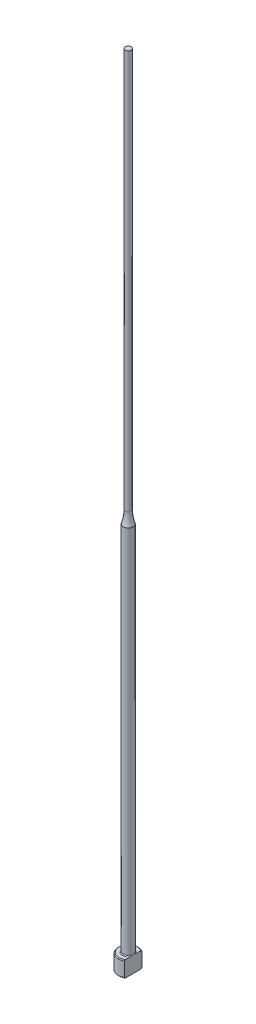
ISO-10303-21;
HEADER;
FILE_DESCRIPTION(('STEP AP214'),'2;1');
FILE_NAME('part.step','',(''),(''),'','','');
FILE_SCHEMA(('AUTOMOTIVE_DESIGN { 1 0 10303 214 1 1 1 1 }'));
ENDSEC;
DATA;
#1=APPLICATION_CONTEXT('core data for automotive mechanical design processes');
#2=APPLICATION_PROTOCOL_DEFINITION('international standard','automotive_design',2000,#1);
#3=PRODUCT_CONTEXT('',#1,'mechanical');
#4=PRODUCT('Part','Part','',(#3));
#5=PRODUCT_RELATED_PRODUCT_CATEGORY('part','',(#4));
#6=PRODUCT_DEFINITION_FORMATION('','',#4);
#7=PRODUCT_DEFINITION_CONTEXT('part definition',#1,'design');
#8=PRODUCT_DEFINITION('design','',#6,#7);
#9=PRODUCT_DEFINITION_SHAPE('','',#8);
#10=(LENGTH_UNIT() NAMED_UNIT(*) SI_UNIT(.MILLI.,.METRE.));
#11=(NAMED_UNIT(*) PLANE_ANGLE_UNIT() SI_UNIT($,.RADIAN.));
#12=(NAMED_UNIT(*) SI_UNIT($,.STERADIAN.) SOLID_ANGLE_UNIT());
#13=UNCERTAINTY_MEASURE_WITH_UNIT(LENGTH_MEASURE(1.E-05),#10,'distance_accuracy_value','');
#14=(GEOMETRIC_REPRESENTATION_CONTEXT(3) GLOBAL_UNCERTAINTY_ASSIGNED_CONTEXT((#13)) GLOBAL_UNIT_ASSIGNED_CONTEXT((#10,
#11,#12)) REPRESENTATION_CONTEXT('',''));
#15=CARTESIAN_POINT('',(0.,0.,0.));
#16=DIRECTION('',(0.,0.,1.));
#17=DIRECTION('',(1.,0.,0.));
#18=AXIS2_PLACEMENT_3D('',#15,#16,#17);
#19=CARTESIAN_POINT('',(-2.49999999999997,4.,0.));
#20=DIRECTION('',(0.,1.,0.));
#21=DIRECTION('',(0.,0.,1.));
#22=AXIS2_PLACEMENT_3D('',#19,#20,#21);
#23=PLANE('',#22);
#24=CARTESIAN_POINT('',(0.,4.,0.));
#25=DIRECTION('',(0.,1.,0.));
#26=DIRECTION('',(0.,0.,1.));
#27=AXIS2_PLACEMENT_3D('',#24,#25,#26);
#28=CIRCLE('',#27,2.3);
#29=CARTESIAN_POINT('',(1.24999999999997,4.,-1.9306734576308));
#30=VERTEX_POINT('',#29);
#31=CARTESIAN_POINT('',(1.24999999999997,4.,1.9306734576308));
#32=VERTEX_POINT('',#31);
#33=EDGE_CURVE('E187',#30,#32,#28,.T.);
#34=ORIENTED_EDGE('',*,*,#33,.T.);
#35=DIRECTION('',(0.,0.,-1.));
#36=VECTOR('',#35,1.);
#37=CARTESIAN_POINT('',(1.24999999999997,4.,0.));
#38=LINE('',#37,#36);
#39=CARTESIAN_POINT('',(1.24999999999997,3.99999999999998,0.734846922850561));
#40=VERTEX_POINT('',#39);
#41=EDGE_CURVE('E57',#32,#40,#38,.T.);
#42=ORIENTED_EDGE('',*,*,#41,.T.);
#43=CARTESIAN_POINT('',(0.,4.,0.));
#44=DIRECTION('',(0.,1.,0.));
#45=DIRECTION('',(0.,0.,1.));
#46=AXIS2_PLACEMENT_3D('',#43,#44,#45);
#47=CIRCLE('',#46,1.44999999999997);
#48=CARTESIAN_POINT('',(1.24999999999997,3.99999999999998,-0.734846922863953));
#49=VERTEX_POINT('',#48);
#50=EDGE_CURVE('E108',#40,#49,#47,.F.);
#51=ORIENTED_EDGE('',*,*,#50,.T.);
#52=EDGE_CURVE('E137',#49,#30,#38,.T.);
#53=ORIENTED_EDGE('',*,*,#52,.T.);
#54=EDGE_LOOP('',(#34,#42,#51,#53));
#55=FACE_BOUND('',#54,.T.);
#56=ADVANCED_FACE('F32',(#55),#23,.T.);
#57=CARTESIAN_POINT('',(0.,259.958771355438,0.));
#58=DIRECTION('',(0.,1.,0.));
#59=DIRECTION('',(0.,0.,1.));
#60=AXIS2_PLACEMENT_3D('',#57,#58,#59);
#61=CYLINDRICAL_SURFACE('',#60,2.49999999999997);
#62=CARTESIAN_POINT('',(0.,3.80000000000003,0.));
#63=DIRECTION('',(0.,1.,0.));
#64=DIRECTION('',(0.,0.,1.));
#65=AXIS2_PLACEMENT_3D('',#62,#63,#64);
#66=CIRCLE('',#65,2.49999999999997);
#67=CARTESIAN_POINT('',(1.24999999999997,3.80000000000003,2.16506350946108));
#68=VERTEX_POINT('',#67);
#69=CARTESIAN_POINT('',(1.24999999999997,3.80000000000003,-2.16506350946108));
#70=VERTEX_POINT('',#69);
#71=EDGE_CURVE('E105',#68,#70,#66,.F.);
#72=ORIENTED_EDGE('',*,*,#71,.T.);
#73=DIRECTION('',(0.,-1.,0.));
#74=VECTOR('',#73,1.);
#75=CARTESIAN_POINT('',(1.24999999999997,200.,-2.16506350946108));
#76=LINE('',#75,#74);
#77=CARTESIAN_POINT('',(1.24999999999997,0.199999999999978,-2.16506350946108));
#78=VERTEX_POINT('',#77);
#79=EDGE_CURVE('E193',#70,#78,#76,.T.);
#80=ORIENTED_EDGE('',*,*,#79,.T.);
#81=CARTESIAN_POINT('',(0.,0.199999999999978,0.));
#82=DIRECTION('',(0.,-1.,0.));
#83=DIRECTION('',(0.,0.,-1.));
#84=AXIS2_PLACEMENT_3D('',#81,#82,#83);
#85=CIRCLE('',#84,2.49999999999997);
#86=CARTESIAN_POINT('',(1.24999999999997,0.199999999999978,2.16506350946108));
#87=VERTEX_POINT('',#86);
#88=EDGE_CURVE('E100',#78,#87,#85,.F.);
#89=ORIENTED_EDGE('',*,*,#88,.T.);
#90=DIRECTION('',(0.,-1.,0.));
#91=VECTOR('',#90,1.);
#92=CARTESIAN_POINT('',(1.24999999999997,200.,2.16506350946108));
#93=LINE('',#92,#91);
#94=EDGE_CURVE('E93',#68,#87,#93,.T.);
#95=ORIENTED_EDGE('',*,*,#94,.F.);
#96=EDGE_LOOP('',(#72,#80,#89,#95));
#97=FACE_BOUND('',#96,.T.);
#98=ADVANCED_FACE('F158',(#97),#61,.T.);
#99=CARTESIAN_POINT('',(0.,0.,0.));
#100=DIRECTION('',(0.,-1.,0.));
#101=DIRECTION('',(0.,0.,-1.));
#102=AXIS2_PLACEMENT_3D('',#99,#100,#101);
#103=PLANE('',#102);
#104=CARTESIAN_POINT('',(0.,0.,0.));
#105=DIRECTION('',(0.,-1.,0.));
#106=DIRECTION('',(0.,0.,-1.));
#107=AXIS2_PLACEMENT_3D('',#104,#105,#106);
#108=CIRCLE('',#107,2.29999999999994);
#109=CARTESIAN_POINT('',(1.24999999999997,0.,1.93067345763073));
#110=VERTEX_POINT('',#109);
#111=CARTESIAN_POINT('',(1.24999999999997,0.,-1.93067345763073));
#112=VERTEX_POINT('',#111);
#113=EDGE_CURVE('E98',#110,#112,#108,.T.);
#114=ORIENTED_EDGE('',*,*,#113,.T.);
#115=DIRECTION('',(0.,0.,1.));
#116=VECTOR('',#115,1.);
#117=CARTESIAN_POINT('',(1.24999999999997,0.,2.16506350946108));
#118=LINE('',#117,#116);
#119=EDGE_CURVE('E83',#112,#110,#118,.T.);
#120=ORIENTED_EDGE('',*,*,#119,.T.);
#121=EDGE_LOOP('',(#114,#120));
#122=FACE_BOUND('',#121,.T.);
#123=ADVANCED_FACE('F103',(#122),#103,.T.);
#124=CARTESIAN_POINT('',(0.,4.,0.));
#125=DIRECTION('',(0.,-1.,0.));
#126=DIRECTION('',(0.,0.,-1.));
#127=AXIS2_PLACEMENT_3D('',#124,#125,#126);
#128=CONICAL_SURFACE('',#127,2.3,0.785398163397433);
#129=ORIENTED_EDGE('',*,*,#71,.F.);
#130=CARTESIAN_POINT('',(1.24999999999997,1.37269850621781,4.76610952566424));
#131=CARTESIAN_POINT('',(1.24999999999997,1.47721375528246,4.6580533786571));
#132=CARTESIAN_POINT('',(1.24999999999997,1.58161686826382,4.54988840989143));
#133=CARTESIAN_POINT('',(1.24999999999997,1.79013244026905,4.33327605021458));
#134=CARTESIAN_POINT('',(1.24999999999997,1.89424489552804,4.22482865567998));
#135=CARTESIAN_POINT('',(1.24999999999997,2.10216338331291,4.00753373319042));
#136=CARTESIAN_POINT('',(1.24999999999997,2.20596923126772,3.89868602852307));
#137=CARTESIAN_POINT('',(1.24999999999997,2.41312192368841,3.68055575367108));
#138=CARTESIAN_POINT('',(1.24999999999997,2.51646877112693,3.57127318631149));
#139=CARTESIAN_POINT('',(1.24999999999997,2.72052253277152,3.35432408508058));
#140=CARTESIAN_POINT('',(1.24999999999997,2.82124112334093,3.24666854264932));
#141=CARTESIAN_POINT('',(1.24999999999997,3.02192410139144,3.03065701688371));
#142=CARTESIAN_POINT('',(1.24999999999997,3.12188849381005,2.92230103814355));
#143=CARTESIAN_POINT('',(1.24999999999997,3.32077037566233,2.70467415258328));
#144=CARTESIAN_POINT('',(1.24999999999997,3.41968808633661,2.59540344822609));
#145=CARTESIAN_POINT('',(1.24999999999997,3.61608273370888,2.37557697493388));
#146=CARTESIAN_POINT('',(1.24999999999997,3.71355972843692,2.26502125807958));
#147=CARTESIAN_POINT('',(1.24999999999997,3.86911393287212,2.08515617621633));
#148=CARTESIAN_POINT('',(1.24999999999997,3.92785594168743,2.01642247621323));
#149=CARTESIAN_POINT('',(1.24999999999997,4.0442937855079,1.87806056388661));
#150=CARTESIAN_POINT('',(1.24999999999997,4.10198951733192,1.80843226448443));
#151=CARTESIAN_POINT('',(1.24999999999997,4.21658041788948,1.66728976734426));
#152=CARTESIAN_POINT('',(1.24999999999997,4.27346067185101,1.59576341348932));
#153=CARTESIAN_POINT('',(1.24999999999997,4.38522965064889,1.45118948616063));
#154=CARTESIAN_POINT('',(1.24999999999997,4.44011885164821,1.37814228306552));
#155=CARTESIAN_POINT('',(1.24999999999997,4.54788773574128,1.22886697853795));
#156=CARTESIAN_POINT('',(1.24999999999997,4.60072420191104,1.15260740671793));
#157=CARTESIAN_POINT('',(1.24999999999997,4.70212030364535,0.997098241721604));
#158=CARTESIAN_POINT('',(1.24999999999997,4.75067405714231,0.917844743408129));
#159=CARTESIAN_POINT('',(1.24999999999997,4.84043729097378,0.756494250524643));
#160=CARTESIAN_POINT('',(1.24999999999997,4.88173033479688,0.674444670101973));
#161=CARTESIAN_POINT('',(1.24999999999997,4.95366083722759,0.505835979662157));
#162=CARTESIAN_POINT('',(1.24999999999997,4.98433405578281,0.419293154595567));
#163=CARTESIAN_POINT('',(1.24999999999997,5.01753107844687,0.289507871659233));
#164=CARTESIAN_POINT('',(1.24999999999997,5.02633539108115,0.247870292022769));
#165=CARTESIAN_POINT('',(1.24999999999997,5.03997448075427,0.163937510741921));
#166=CARTESIAN_POINT('',(1.24999999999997,5.0448096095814,0.12164236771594));
#167=CARTESIAN_POINT('',(1.24999999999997,5.0501678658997,0.0369068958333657));
#168=CARTESIAN_POINT('',(1.24999999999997,5.05070431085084,-0.00553257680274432));
#169=CARTESIAN_POINT('',(1.24999999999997,5.04746162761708,-0.0902467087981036));
#170=CARTESIAN_POINT('',(1.24999999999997,5.04368214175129,-0.132521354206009));
#171=CARTESIAN_POINT('',(1.24999999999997,5.0321226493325,-0.21613542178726));
#172=CARTESIAN_POINT('',(1.24999999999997,5.02437758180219,-0.2574797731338));
#173=CARTESIAN_POINT('',(1.24999999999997,5.00536735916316,-0.339354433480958));
#174=CARTESIAN_POINT('',(1.24999999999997,4.99410082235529,-0.379884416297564));
#175=CARTESIAN_POINT('',(1.24999999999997,4.96852211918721,-0.460209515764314));
#176=CARTESIAN_POINT('',(1.24999999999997,4.954193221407,-0.499999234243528));
#177=CARTESIAN_POINT('',(1.24999999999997,4.92306392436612,-0.578577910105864));
#178=CARTESIAN_POINT('',(1.24999999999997,4.90626403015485,-0.617367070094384));
#179=CARTESIAN_POINT('',(1.24999999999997,4.85269034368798,-0.732719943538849));
#180=CARTESIAN_POINT('',(1.24999999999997,4.81287978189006,-0.807869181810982));
#181=CARTESIAN_POINT('',(1.24999999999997,4.72799210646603,-0.955157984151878));
#182=CARTESIAN_POINT('',(1.24999999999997,4.68290855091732,-1.02729371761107));
#183=CARTESIAN_POINT('',(1.24999999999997,4.58903993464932,-1.16950551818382));
#184=CARTESIAN_POINT('',(1.24999999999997,4.5402409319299,-1.23957230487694));
#185=CARTESIAN_POINT('',(1.24999999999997,4.44021824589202,-1.37788366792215));
#186=CARTESIAN_POINT('',(1.24999999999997,4.38899576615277,-1.44612912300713));
#187=CARTESIAN_POINT('',(1.24999999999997,4.28411092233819,-1.58215279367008));
#188=CARTESIAN_POINT('',(1.24999999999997,4.23042529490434,-1.64991298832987));
#189=CARTESIAN_POINT('',(1.24999999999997,4.12172412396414,-1.7843605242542));
#190=CARTESIAN_POINT('',(1.24999999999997,4.06670849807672,-1.85104779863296));
#191=CARTESIAN_POINT('',(1.24999999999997,3.90044437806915,-2.04954410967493));
#192=CARTESIAN_POINT('',(1.24999999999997,3.78772044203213,-2.1801152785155));
#193=CARTESIAN_POINT('',(1.24999999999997,3.57927088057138,-2.41711311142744));
#194=CARTESIAN_POINT('',(1.24999999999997,3.48391557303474,-2.52386864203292));
#195=CARTESIAN_POINT('',(1.24999999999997,3.29202937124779,-2.73632311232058));
#196=CARTESIAN_POINT('',(1.24999999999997,3.19549844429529,-2.84202202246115));
#197=CARTESIAN_POINT('',(1.24999999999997,2.90446939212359,-3.15815976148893));
#198=CARTESIAN_POINT('',(1.24999999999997,2.70871394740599,-3.36743889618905));
#199=CARTESIAN_POINT('',(1.24999999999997,2.32338273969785,-3.77561196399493));
#200=CARTESIAN_POINT('',(1.24999999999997,2.13388401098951,-3.97457897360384));
#201=CARTESIAN_POINT('',(1.24999999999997,1.84887947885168,-4.27209258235));
#202=CARTESIAN_POINT('',(1.24999999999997,1.75380504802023,-4.37105278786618));
#203=CARTESIAN_POINT('',(1.24999999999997,1.56341833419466,-4.56874260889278));
#204=CARTESIAN_POINT('',(1.24999999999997,1.46810605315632,-4.66747222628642));
#205=CARTESIAN_POINT('',(1.24999999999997,1.37269850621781,-4.76610952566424));
#206=B_SPLINE_CURVE_WITH_KNOTS('',3,(#130,#131,#132,#133,#134,#135,#136,#137,#138,#139,#140,
#141,#142,#143,#144,#145,#146,#147,#148,#149,#150,#151,#152,#153,#154,#155,#156,#157,#158,#159,
#160,#161,#162,#163,#164,#165,#166,#167,#168,#169,#170,#171,#172,#173,#174,#175,#176,#177,#178,
#179,#180,#181,#182,#183,#184,#185,#186,#187,#188,#189,#190,#191,#192,#193,#194,#195,#196,#197,
#198,#199,#200,#201,#202,#203,#204,#205),.UNSPECIFIED.,.F.,.F.,(4,2,2,2,2,2,2,2,2,2,2,2,2,2,2,2,
2,2,2,2,2,2,2,2,2,2,2,2,2,2,2,2,2,2,2,2,2,4),(0.,0.450994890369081,0.901995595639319,
1.35322763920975,1.80445675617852,2.24672733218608,2.6889950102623,3.13116725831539,
3.57332164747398,3.84456018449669,4.11582532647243,4.38995864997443,4.66402597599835,
4.94225842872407,5.22086725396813,5.49602313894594,5.77024327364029,5.89775644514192,
6.02525831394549,6.15236502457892,6.27948226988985,6.4054983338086,6.531563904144,
6.65833670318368,6.78508362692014,7.03983854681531,7.2949080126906,7.55098686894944,
7.80693985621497,8.06626716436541,8.32561057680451,8.84304654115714,9.27246240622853,
9.70189024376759,10.5615524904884,11.385852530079,11.7975442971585,12.2092326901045),.UNSPECIFIED.);
#207=EDGE_CURVE('E136',#68,#32,#206,.T.);
#208=ORIENTED_EDGE('',*,*,#207,.T.);
#209=ORIENTED_EDGE('',*,*,#33,.F.);
#210=EDGE_CURVE('E128',#30,#70,#206,.T.);
#211=ORIENTED_EDGE('',*,*,#210,.T.);
#212=EDGE_LOOP('',(#129,#208,#209,#211));
#213=FACE_BOUND('',#212,.T.);
#214=ADVANCED_FACE('F144',(#213),#128,.T.);
#215=CARTESIAN_POINT('',(0.,0.199999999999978,0.));
#216=DIRECTION('',(0.,1.,0.));
#217=DIRECTION('',(0.,0.,1.));
#218=AXIS2_PLACEMENT_3D('',#215,#216,#217);
#219=CONICAL_SURFACE('',#218,2.49999999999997,0.785398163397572);
#220=ORIENTED_EDGE('',*,*,#88,.F.);
#221=CARTESIAN_POINT('',(1.24999999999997,2.62730149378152,-4.76610952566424));
#222=CARTESIAN_POINT('',(1.24999999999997,2.52278624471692,-4.65805337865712));
#223=CARTESIAN_POINT('',(1.24999999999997,2.41838313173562,-4.54988840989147));
#224=CARTESIAN_POINT('',(1.24999999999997,2.20986755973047,-4.33327605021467));
#225=CARTESIAN_POINT('',(1.24999999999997,2.10575510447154,-4.22482865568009));
#226=CARTESIAN_POINT('',(1.24999999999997,1.89783661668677,-4.00753373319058));
#227=CARTESIAN_POINT('',(1.24999999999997,1.794030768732,-3.89868602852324));
#228=CARTESIAN_POINT('',(1.24999999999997,1.58687807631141,-3.6805557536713));
#229=CARTESIAN_POINT('',(1.24999999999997,1.48353122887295,-3.57127318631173));
#230=CARTESIAN_POINT('',(1.24999999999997,1.27947746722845,-3.35432408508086));
#231=CARTESIAN_POINT('',(1.24999999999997,1.17875887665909,-3.24666854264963));
#232=CARTESIAN_POINT('',(1.24999999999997,0.978075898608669,-3.03065701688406));
#233=CARTESIAN_POINT('',(1.24999999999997,0.878111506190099,-2.92230103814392));
#234=CARTESIAN_POINT('',(1.24999999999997,0.67922962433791,-2.70467415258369));
#235=CARTESIAN_POINT('',(1.24999999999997,0.580311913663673,-2.59540344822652));
#236=CARTESIAN_POINT('',(1.24999999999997,0.383917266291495,-2.37557697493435));
#237=CARTESIAN_POINT('',(1.24999999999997,0.286440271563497,-2.26502125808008));
#238=CARTESIAN_POINT('',(1.24999999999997,0.130886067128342,-2.08515617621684));
#239=CARTESIAN_POINT('',(1.24999999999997,0.0721440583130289,-2.01642247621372));
#240=CARTESIAN_POINT('',(1.24999999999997,-0.0442937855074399,-1.87806056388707));
#241=CARTESIAN_POINT('',(1.24999999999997,-0.101989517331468,-1.80843226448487));
#242=CARTESIAN_POINT('',(1.24999999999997,-0.216580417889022,-1.66728976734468));
#243=CARTESIAN_POINT('',(1.24999999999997,-0.273460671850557,-1.59576341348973));
#244=CARTESIAN_POINT('',(1.24999999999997,-0.385229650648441,-1.45118948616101));
#245=CARTESIAN_POINT('',(1.24999999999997,-0.440118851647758,-1.37814228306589));
#246=CARTESIAN_POINT('',(1.24999999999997,-0.547887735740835,-1.22886697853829));
#247=CARTESIAN_POINT('',(1.24999999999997,-0.600724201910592,-1.15260740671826));
#248=CARTESIAN_POINT('',(1.24999999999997,-0.702120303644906,-0.99709824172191));
#249=CARTESIAN_POINT('',(1.24999999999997,-0.750674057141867,-0.917844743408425));
#250=CARTESIAN_POINT('',(1.24999999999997,-0.840437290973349,-0.756494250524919));
#251=CARTESIAN_POINT('',(1.24999999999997,-0.881730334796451,-0.67444467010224));
#252=CARTESIAN_POINT('',(1.24999999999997,-0.953660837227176,-0.505835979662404));
#253=CARTESIAN_POINT('',(1.24999999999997,-0.984334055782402,-0.419293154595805));
#254=CARTESIAN_POINT('',(1.24999999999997,-1.01753107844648,-0.289507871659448));
#255=CARTESIAN_POINT('',(1.24999999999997,-1.02633539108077,-0.247870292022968));
#256=CARTESIAN_POINT('',(1.24999999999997,-1.0399744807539,-0.163937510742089));
#257=CARTESIAN_POINT('',(1.24999999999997,-1.04480960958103,-0.121642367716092));
#258=CARTESIAN_POINT('',(1.24999999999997,-1.05016786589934,-0.036906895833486));
#259=CARTESIAN_POINT('',(1.24999999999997,-1.05070431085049,0.00553257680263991));
#260=CARTESIAN_POINT('',(1.24999999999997,-1.04746162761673,0.0902467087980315));
#261=CARTESIAN_POINT('',(1.24999999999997,-1.04368214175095,0.132521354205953));
#262=CARTESIAN_POINT('',(1.24999999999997,-1.03212264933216,0.216135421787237));
#263=CARTESIAN_POINT('',(1.24999999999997,-1.02437758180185,0.257479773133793));
#264=CARTESIAN_POINT('',(1.24999999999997,-1.00536735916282,0.339354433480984));
#265=CARTESIAN_POINT('',(1.24999999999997,-0.99410082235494,0.379884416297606));
#266=CARTESIAN_POINT('',(1.24999999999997,-0.968522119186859,0.460209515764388));
#267=CARTESIAN_POINT('',(1.24999999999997,-0.954193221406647,0.499999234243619));
#268=CARTESIAN_POINT('',(1.24999999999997,-0.923063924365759,0.578577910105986));
#269=CARTESIAN_POINT('',(1.24999999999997,-0.906264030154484,0.617367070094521));
#270=CARTESIAN_POINT('',(1.24999999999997,-0.852690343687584,0.732719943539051));
#271=CARTESIAN_POINT('',(1.24999999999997,-0.812879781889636,0.807869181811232));
#272=CARTESIAN_POINT('',(1.24999999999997,-0.72799210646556,0.955157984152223));
#273=CARTESIAN_POINT('',(1.24999999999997,-0.682908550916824,1.02729371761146));
#274=CARTESIAN_POINT('',(1.24999999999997,-0.58903993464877,1.1695055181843));
#275=CARTESIAN_POINT('',(1.24999999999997,-0.540240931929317,1.23957230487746));
#276=CARTESIAN_POINT('',(1.24999999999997,-0.440218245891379,1.37788366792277));
#277=CARTESIAN_POINT('',(1.24999999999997,-0.388995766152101,1.44612912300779));
#278=CARTESIAN_POINT('',(1.24999999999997,-0.284110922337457,1.58215279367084));
#279=CARTESIAN_POINT('',(1.24999999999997,-0.230425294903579,1.64991298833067));
#280=CARTESIAN_POINT('',(1.24999999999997,-0.121724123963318,1.78436052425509));
#281=CARTESIAN_POINT('',(1.24999999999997,-0.066708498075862,1.8510477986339));
#282=CARTESIAN_POINT('',(1.24999999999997,0.0995556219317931,2.049544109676));
#283=CARTESIAN_POINT('',(1.24999999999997,0.212279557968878,2.18011527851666));
#284=CARTESIAN_POINT('',(1.24999999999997,0.420729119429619,2.41711311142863));
#285=CARTESIAN_POINT('',(1.24999999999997,0.516084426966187,2.52386864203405));
#286=CARTESIAN_POINT('',(1.24999999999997,0.707970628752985,2.73632311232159));
#287=CARTESIAN_POINT('',(1.24999999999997,0.804501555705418,2.84202202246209));
#288=CARTESIAN_POINT('',(1.24999999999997,1.09553060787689,3.1581597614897));
#289=CARTESIAN_POINT('',(1.24999999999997,1.29128605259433,3.36743889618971));
#290=CARTESIAN_POINT('',(1.24999999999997,1.67661726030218,3.77561196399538));
#291=CARTESIAN_POINT('',(1.24999999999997,1.86611598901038,3.97457897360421));
#292=CARTESIAN_POINT('',(1.24999999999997,2.151120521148,4.27209258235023));
#293=CARTESIAN_POINT('',(1.24999999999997,2.24619495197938,4.37105278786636));
#294=CARTESIAN_POINT('',(1.24999999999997,2.43658166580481,4.56874260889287));
#295=CARTESIAN_POINT('',(1.24999999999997,2.53189394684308,4.66747222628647));
#296=CARTESIAN_POINT('',(1.24999999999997,2.62730149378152,4.76610952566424));
#297=B_SPLINE_CURVE_WITH_KNOTS('',3,(#221,#222,#223,#224,#225,#226,#227,#228,#229,#230,#231,
#232,#233,#234,#235,#236,#237,#238,#239,#240,#241,#242,#243,#244,#245,#246,#247,#248,#249,#250,
#251,#252,#253,#254,#255,#256,#257,#258,#259,#260,#261,#262,#263,#264,#265,#266,#267,#268,#269,
#270,#271,#272,#273,#274,#275,#276,#277,#278,#279,#280,#281,#282,#283,#284,#285,#286,#287,#288,
#289,#290,#291,#292,#293,#294,#295,#296),.UNSPECIFIED.,.F.,.F.,(4,2,2,2,2,2,2,2,2,2,2,2,2,2,2,2,
2,2,2,2,2,2,2,2,2,2,2,2,2,2,2,2,2,2,2,2,2,4),(0.,0.45099489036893,0.901995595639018,
1.3532276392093,1.80445675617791,2.24672733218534,2.68899501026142,3.13116725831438,
3.57332164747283,3.84456018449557,4.11582532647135,4.38995864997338,4.66402597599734,
4.94225842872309,5.22086725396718,5.49602313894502,5.77024327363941,5.89775644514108,
6.0252583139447,6.15236502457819,6.27948226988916,6.40549833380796,6.5315639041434,
6.65833670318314,6.78508362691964,7.03983854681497,7.29490801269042,7.55098686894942,
7.80693985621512,8.06626716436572,8.32561057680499,8.84304654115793,9.27246240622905,
9.70189024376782,10.5615524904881,11.3858525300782,11.7975442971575,12.2092326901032),.UNSPECIFIED.);
#298=EDGE_CURVE('E86',#78,#112,#297,.T.);
#299=ORIENTED_EDGE('',*,*,#298,.T.);
#300=ORIENTED_EDGE('',*,*,#113,.F.);
#301=EDGE_CURVE('E89',#110,#87,#297,.T.);
#302=ORIENTED_EDGE('',*,*,#301,.T.);
#303=EDGE_LOOP('',(#220,#299,#300,#302));
#304=FACE_BOUND('',#303,.T.);
#305=ADVANCED_FACE('F97',(#304),#219,.T.);
#306=CARTESIAN_POINT('',(0.,4.19999999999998,0.));
#307=DIRECTION('',(0.,1.,0.));
#308=DIRECTION('',(0.,0.,1.));
#309=AXIS2_PLACEMENT_3D('',#306,#307,#308);
#310=TOROIDAL_SURFACE('',#309,1.44999999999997,0.2);
#311=CARTESIAN_POINT('',(1.24999999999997,4.19999999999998,0.));
#312=CARTESIAN_POINT('',(1.24999999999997,4.20000051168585,-1.97682160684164E-10));
#313=CARTESIAN_POINT('',(1.24999999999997,4.20000102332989,-1.08908071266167E-07));
#314=CARTESIAN_POINT('',(1.24999999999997,4.20000200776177,-4.52594777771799E-07));
#315=CARTESIAN_POINT('',(1.24999999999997,4.20000247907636,-6.9099305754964E-07));
#316=CARTESIAN_POINT('',(1.24999999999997,4.20000341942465,-1.26357946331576E-06));
#317=CARTESIAN_POINT('',(1.24999999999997,4.20000388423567,-1.60457621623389E-06));
#318=CARTESIAN_POINT('',(1.24999999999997,4.20000476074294,-2.33954904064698E-06));
#319=CARTESIAN_POINT('',(1.24999999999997,4.2000051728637,-2.73304152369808E-06));
#320=CARTESIAN_POINT('',(1.24999999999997,4.20000655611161,-4.14544018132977E-06));
#321=CARTESIAN_POINT('',(1.24999999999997,4.20000745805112,-5.23310098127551E-06));
#322=CARTESIAN_POINT('',(1.24999999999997,4.20000906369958,-7.47950368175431E-06));
#323=CARTESIAN_POINT('',(1.24999999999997,4.20000977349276,-8.63414445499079E-06));
#324=CARTESIAN_POINT('',(1.24999999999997,4.20001244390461,-1.31453477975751E-05));
#325=CARTESIAN_POINT('',(1.24999999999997,4.20001426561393,-1.65880556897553E-05));
#326=CARTESIAN_POINT('',(1.24999999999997,4.20001724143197,-2.33729030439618E-05));
#327=CARTESIAN_POINT('',(1.24999999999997,4.20001844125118,-2.66956155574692E-05));
#328=CARTESIAN_POINT('',(1.24999999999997,4.20002354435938,-4.08635087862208E-05));
#329=CARTESIAN_POINT('',(1.24999999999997,4.20002741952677,-5.17114616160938E-05));
#330=CARTESIAN_POINT('',(1.24999999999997,4.20003363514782,-7.2005767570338E-05));
#331=CARTESIAN_POINT('',(1.24999999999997,4.20003612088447,-8.14057067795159E-05));
#332=CARTESIAN_POINT('',(1.24999999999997,4.20005581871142,-0.000149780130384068));
#333=CARTESIAN_POINT('',(1.24999999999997,4.20008094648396,-0.00020612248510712));
#334=CARTESIAN_POINT('',(1.24999999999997,4.20017507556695,-0.000425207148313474));
#335=CARTESIAN_POINT('',(1.24999999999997,4.20023819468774,-0.000589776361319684));
#336=CARTESIAN_POINT('',(1.24999999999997,4.20048692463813,-0.00122878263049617));
#337=CARTESIAN_POINT('',(1.24999999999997,4.20067870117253,-0.00170134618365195));
#338=CARTESIAN_POINT('',(1.24999999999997,4.2014602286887,-0.00363636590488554));
#339=CARTESIAN_POINT('',(1.24999999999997,4.20204298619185,-0.00510090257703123));
#340=CARTESIAN_POINT('',(1.24999999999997,4.20939719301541,-0.0235712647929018));
#341=CARTESIAN_POINT('',(1.24999999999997,4.21621259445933,-0.0405643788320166));
#342=CARTESIAN_POINT('',(1.24999999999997,4.22951000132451,-0.0739606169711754));
#343=CARTESIAN_POINT('',(1.24999999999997,4.23599508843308,-0.0903626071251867));
#344=CARTESIAN_POINT('',(1.24999999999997,4.24961430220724,-0.125111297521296));
#345=CARTESIAN_POINT('',(1.24999999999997,4.2567364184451,-0.1434628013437));
#346=CARTESIAN_POINT('',(1.24999999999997,4.27085039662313,-0.180427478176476));
#347=CARTESIAN_POINT('',(1.24999999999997,4.27784022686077,-0.199041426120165));
#348=CARTESIAN_POINT('',(1.24999999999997,4.29479134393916,-0.245221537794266));
#349=CARTESIAN_POINT('',(1.24999999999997,4.30459026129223,-0.272848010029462));
#350=CARTESIAN_POINT('',(1.24999999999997,4.32310234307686,-0.327738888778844));
#351=CARTESIAN_POINT('',(1.24999999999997,4.3318356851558,-0.354996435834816));
#352=CARTESIAN_POINT('',(1.24999999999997,4.3493656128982,-0.413744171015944));
#353=CARTESIAN_POINT('',(1.24999999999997,4.35799470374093,-0.44528522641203));
#354=CARTESIAN_POINT('',(1.24999999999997,4.37338463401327,-0.50909191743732));
#355=CARTESIAN_POINT('',(1.24999999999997,4.38013036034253,-0.541361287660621));
#356=CARTESIAN_POINT('',(1.24999999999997,4.39136059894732,-0.608339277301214));
#357=CARTESIAN_POINT('',(1.24999999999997,4.39568167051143,-0.643076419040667));
#358=CARTESIAN_POINT('',(1.24999999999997,4.40037605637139,-0.712733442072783));
#359=CARTESIAN_POINT('',(1.24999999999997,4.40076553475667,-0.747651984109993));
#360=CARTESIAN_POINT('',(1.24999999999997,4.39677668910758,-0.808103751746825));
#361=CARTESIAN_POINT('',(1.24999999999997,4.39361441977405,-0.833711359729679));
#362=CARTESIAN_POINT('',(1.24999999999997,4.38355990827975,-0.883915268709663));
#363=CARTESIAN_POINT('',(1.24999999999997,4.37671813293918,-0.908520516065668));
#364=CARTESIAN_POINT('',(1.24999999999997,4.36252570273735,-0.944879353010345));
#365=CARTESIAN_POINT('',(1.24999999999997,4.35688428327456,-0.957298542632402));
#366=CARTESIAN_POINT('',(1.24999999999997,4.34399066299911,-0.981318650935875));
#367=CARTESIAN_POINT('',(1.24999999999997,4.33673636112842,-0.992918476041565));
#368=CARTESIAN_POINT('',(1.24999999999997,4.32199744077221,-1.01267533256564));
#369=CARTESIAN_POINT('',(1.24999999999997,4.31482723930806,-1.02106482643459));
#370=CARTESIAN_POINT('',(1.24999999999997,4.29924321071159,-1.03659690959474));
#371=CARTESIAN_POINT('',(1.24999999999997,4.29083198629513,-1.04374204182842));
#372=CARTESIAN_POINT('',(1.24999999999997,4.27498600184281,-1.05478694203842));
#373=CARTESIAN_POINT('',(1.24999999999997,4.26780814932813,-1.059053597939));
#374=CARTESIAN_POINT('',(1.24999999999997,4.25284782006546,-1.06635953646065));
#375=CARTESIAN_POINT('',(1.24999999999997,4.24506572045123,-1.06939957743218));
#376=CARTESIAN_POINT('',(1.24999999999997,4.22901828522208,-1.07404931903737));
#377=CARTESIAN_POINT('',(1.24999999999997,4.22074990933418,-1.07564870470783));
#378=CARTESIAN_POINT('',(1.24999999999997,4.20405985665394,-1.07723717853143));
#379=CARTESIAN_POINT('',(1.24999999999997,4.19563825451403,-1.07722703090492));
#380=CARTESIAN_POINT('',(1.24999999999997,4.17988128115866,-1.07569157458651));
#381=CARTESIAN_POINT('',(1.24999999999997,4.17252879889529,-1.0743339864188));
#382=CARTESIAN_POINT('',(1.24999999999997,4.15814333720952,-1.07044616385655));
#383=CARTESIAN_POINT('',(1.24999999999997,4.15111040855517,-1.06791574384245));
#384=CARTESIAN_POINT('',(1.24999999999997,4.13724955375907,-1.06171920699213));
#385=CARTESIAN_POINT('',(1.24999999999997,4.13043935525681,-1.05801386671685));
#386=CARTESIAN_POINT('',(1.24999999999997,4.11740316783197,-1.04969609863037));
#387=CARTESIAN_POINT('',(1.24999999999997,4.11117742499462,-1.04508329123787));
#388=CARTESIAN_POINT('',(1.24999999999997,4.0958619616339,-1.03220341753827));
#389=CARTESIAN_POINT('',(1.24999999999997,4.08723799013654,-1.02338140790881));
#390=CARTESIAN_POINT('',(1.24999999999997,4.07148817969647,-1.00448021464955));
#391=CARTESIAN_POINT('',(1.24999999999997,4.06436716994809,-0.994397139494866));
#392=CARTESIAN_POINT('',(1.24999999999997,4.04800089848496,-0.96769446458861));
#393=CARTESIAN_POINT('',(1.24999999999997,4.0397014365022,-0.950498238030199));
#394=CARTESIAN_POINT('',(1.24999999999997,4.02582422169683,-0.915117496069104));
#395=CARTESIAN_POINT('',(1.24999999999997,4.02024415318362,-0.89693383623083));
#396=CARTESIAN_POINT('',(1.24999999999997,4.00805724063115,-0.846781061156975));
#397=CARTESIAN_POINT('',(1.24999999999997,4.00359525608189,-0.814297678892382));
#398=CARTESIAN_POINT('',(1.24999999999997,3.99933348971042,-0.748574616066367));
#399=CARTESIAN_POINT('',(1.24999999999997,3.99961552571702,-0.71533156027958));
#400=CARTESIAN_POINT('',(1.24999999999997,4.00446632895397,-0.637920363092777));
#401=CARTESIAN_POINT('',(1.24999999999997,4.0104488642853,-0.593849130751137));
#402=CARTESIAN_POINT('',(1.24999999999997,4.02681929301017,-0.50640159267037));
#403=CARTESIAN_POINT('',(1.24999999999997,4.03722697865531,-0.463029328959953));
#404=CARTESIAN_POINT('',(1.24999999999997,4.060071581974,-0.380638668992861));
#405=CARTESIAN_POINT('',(1.24999999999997,4.07227412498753,-0.34155342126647));
#406=CARTESIAN_POINT('',(1.24999999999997,4.09824323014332,-0.264347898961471));
#407=CARTESIAN_POINT('',(1.24999999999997,4.11199311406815,-0.226221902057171));
#408=CARTESIAN_POINT('',(1.24999999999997,4.13108825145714,-0.175350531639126));
#409=CARTESIAN_POINT('',(1.24999999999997,4.13599999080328,-0.162438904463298));
#410=CARTESIAN_POINT('',(1.24999999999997,4.14604281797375,-0.136318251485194));
#411=CARTESIAN_POINT('',(1.24999999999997,4.15117629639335,-0.123110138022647));
#412=CARTESIAN_POINT('',(1.24999999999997,4.16341702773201,-0.0918425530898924));
#413=CARTESIAN_POINT('',(1.24999999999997,4.17055250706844,-0.0737943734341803));
#414=CARTESIAN_POINT('',(1.24999999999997,4.18426943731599,-0.0393586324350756));
#415=CARTESIAN_POINT('',(1.24999999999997,4.19084281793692,-0.0229681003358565));
#416=CARTESIAN_POINT('',(1.24999999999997,4.19795564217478,-0.00510438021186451));
#417=CARTESIAN_POINT('',(1.24999999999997,4.19853702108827,-0.00364331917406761));
#418=CARTESIAN_POINT('',(1.24999999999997,4.19931818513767,-0.00170914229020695));
#419=CARTESIAN_POINT('',(1.24999999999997,4.19951102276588,-0.00123396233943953));
#420=CARTESIAN_POINT('',(1.24999999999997,4.19976104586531,-0.000591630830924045));
#421=CARTESIAN_POINT('',(1.24999999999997,4.19982443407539,-0.000426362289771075));
#422=CARTESIAN_POINT('',(1.24999999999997,4.19991892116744,-0.000206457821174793));
#423=CARTESIAN_POINT('',(1.24999999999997,4.19994410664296,-0.000149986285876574));
#424=CARTESIAN_POINT('',(1.24999999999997,4.19996383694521,-8.14647488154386E-05));
#425=CARTESIAN_POINT('',(1.24999999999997,4.19996632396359,-7.20551568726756E-05));
#426=CARTESIAN_POINT('',(1.24999999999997,4.19997254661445,-5.17396177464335E-05));
#427=CARTESIAN_POINT('',(1.24999999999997,4.19997642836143,-4.08803463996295E-05));
#428=CARTESIAN_POINT('',(1.24999999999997,4.19998153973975,-2.66997573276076E-05));
#429=CARTESIAN_POINT('',(1.24999999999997,4.19998274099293,-2.33755457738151E-05));
#430=CARTESIAN_POINT('',(1.24999999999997,4.1999857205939,-1.65878758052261E-05));
#431=CARTESIAN_POINT('',(1.24999999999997,4.19998754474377,-1.31438994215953E-05));
#432=CARTESIAN_POINT('',(1.24999999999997,4.19999021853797,-8.63150511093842E-06));
#433=CARTESIAN_POINT('',(1.24999999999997,4.19999092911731,-7.47674880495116E-06));
#434=CARTESIAN_POINT('',(1.24999999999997,4.19999253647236,-5.23027080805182E-06));
#435=CARTESIAN_POINT('',(1.24999999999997,4.19999343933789,-4.14265821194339E-06));
#436=CARTESIAN_POINT('',(1.24999999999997,4.19999482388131,-2.73051190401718E-06));
#437=CARTESIAN_POINT('',(1.24999999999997,4.19999523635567,-2.33712918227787E-06));
#438=CARTESIAN_POINT('',(1.24999999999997,4.1999961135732,-1.60243917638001E-06));
#439=CARTESIAN_POINT('',(1.24999999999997,4.19999657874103,-1.26161620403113E-06));
#440=CARTESIAN_POINT('',(1.24999999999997,4.19999751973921,-6.89449589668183E-07));
#441=CARTESIAN_POINT('',(1.24999999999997,4.1999979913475,-4.51288695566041E-07));
#442=CARTESIAN_POINT('',(1.24999999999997,4.19999897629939,-1.08178106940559E-07));
#443=CARTESIAN_POINT('',(1.24999999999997,4.19999948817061,1.97737602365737E-10));
#444=CARTESIAN_POINT('',(1.24999999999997,4.19999999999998,0.));
#445=B_SPLINE_CURVE_WITH_KNOTS('',3,(#311,#312,#313,#314,#315,#316,#317,#318,#319,#320,#321,
#322,#323,#324,#325,#326,#327,#328,#329,#330,#331,#332,#333,#334,#335,#336,#337,#338,#339,#340,
#341,#342,#343,#344,#345,#346,#347,#348,#349,#350,#351,#352,#353,#354,#355,#356,#357,#358,#359,
#360,#361,#362,#363,#364,#365,#366,#367,#368,#369,#370,#371,#372,#373,#374,#375,#376,#377,#378,
#379,#380,#381,#382,#383,#384,#385,#386,#387,#388,#389,#390,#391,#392,#393,#394,#395,#396,#397,
#398,#399,#400,#401,#402,#403,#404,#405,#406,#407,#408,#409,#410,#411,#412,#413,#414,#415,#416,
#417,#418,#419,#420,#421,#422,#423,#424,#425,#426,#427,#428,#429,#430,#431,#432,#433,#434,#435,
#436,#437,#438,#439,#440,#441,#442,#443,#444),.UNSPECIFIED.,.T.,.F.,(4,2,2,2,2,2,2,2,2,2,2,2,2,
2,2,2,2,2,2,2,2,2,2,2,2,2,2,2,2,2,2,2,2,2,2,2,2,2,2,2,2,2,2,2,2,2,2,2,2,2,2,2,2,2,2,2,2,2,2,2,2,
2,2,2,2,2,4),(0.,1.53427571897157E-06,3.11115051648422E-06,4.83351630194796E-06,
6.54098938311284E-06,1.07594292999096E-05,1.48222850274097E-05,2.64707312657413E-05,
3.70576286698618E-05,7.16088725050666E-05,0.000100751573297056,0.000285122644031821,
0.00081447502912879,0.00234373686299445,0.00707317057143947,0.0619940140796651,
0.114907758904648,0.17396170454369,0.233609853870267,0.321537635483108,0.40738870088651,
0.505443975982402,0.604264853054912,0.709126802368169,0.813557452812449,0.890773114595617,
0.966955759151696,1.00778845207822,1.04867465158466,1.08167318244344,1.11460346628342,
1.13955805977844,1.16449720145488,1.1896135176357,1.2147179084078,1.23704542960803,
1.25937648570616,1.28254952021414,1.30573226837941,1.34253218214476,1.37944859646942,
1.43640829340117,1.49331940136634,1.59113685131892,1.69064301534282,1.82371118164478,
1.9573808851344,2.08016146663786,2.20172662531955,2.2431696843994,2.28568093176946,
2.34390494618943,2.39687801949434,2.40159623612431,2.40313396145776,2.40366556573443,
2.40385035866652,2.40387953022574,2.403914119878,2.40392471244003,2.403936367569,
2.4039404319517,2.40394465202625,2.40394636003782,2.403948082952,2.40394966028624,
2.40395119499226),.UNSPECIFIED.);
#446=CARTESIAN_POINT('',(1.24999999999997,4.19999999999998,0.));
#447=VERTEX_POINT('',#446);
#448=EDGE_CURVE('E11',#49,#447,#445,.T.);
#449=ORIENTED_EDGE('',*,*,#448,.F.);
#450=ORIENTED_EDGE('',*,*,#50,.F.);
#451=CARTESIAN_POINT('',(1.24999999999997,4.19999999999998,0.));
#452=CARTESIAN_POINT('',(1.24999999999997,4.19999948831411,1.9768217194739E-10));
#453=CARTESIAN_POINT('',(1.24999999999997,4.19999897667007,1.08908071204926E-07));
#454=CARTESIAN_POINT('',(1.24999999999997,4.19999799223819,4.52594777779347E-07));
#455=CARTESIAN_POINT('',(1.24999999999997,4.19999752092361,6.9099305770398E-07));
#456=CARTESIAN_POINT('',(1.24999999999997,4.19999658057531,1.26357946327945E-06));
#457=CARTESIAN_POINT('',(1.24999999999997,4.19999611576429,1.6045762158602E-06));
#458=CARTESIAN_POINT('',(1.24999999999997,4.19999523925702,2.33954904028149E-06));
#459=CARTESIAN_POINT('',(1.24999999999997,4.19999482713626,2.73304152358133E-06));
#460=CARTESIAN_POINT('',(1.24999999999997,4.19999344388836,4.14544018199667E-06));
#461=CARTESIAN_POINT('',(1.24999999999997,4.19999254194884,5.23310098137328E-06));
#462=CARTESIAN_POINT('',(1.24999999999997,4.19999093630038,7.47950368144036E-06));
#463=CARTESIAN_POINT('',(1.24999999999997,4.19999022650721,8.63414445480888E-06));
#464=CARTESIAN_POINT('',(1.24999999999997,4.19998755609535,1.31453477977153E-05));
#465=CARTESIAN_POINT('',(1.24999999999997,4.19998573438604,1.65880556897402E-05));
#466=CARTESIAN_POINT('',(1.24999999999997,4.19998275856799,2.33729030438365E-05));
#467=CARTESIAN_POINT('',(1.24999999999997,4.19998155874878,2.66956155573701E-05));
#468=CARTESIAN_POINT('',(1.24999999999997,4.19997645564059,4.0863508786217E-05));
#469=CARTESIAN_POINT('',(1.24999999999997,4.1999725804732,5.17114616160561E-05));
#470=CARTESIAN_POINT('',(1.24999999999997,4.19996636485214,7.20057675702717E-05));
#471=CARTESIAN_POINT('',(1.24999999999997,4.19996387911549,8.1405706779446E-05));
#472=CARTESIAN_POINT('',(1.24999999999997,4.19994418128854,0.000149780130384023));
#473=CARTESIAN_POINT('',(1.24999999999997,4.199919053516,0.000206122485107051));
#474=CARTESIAN_POINT('',(1.24999999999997,4.19982492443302,0.000425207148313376));
#475=CARTESIAN_POINT('',(1.24999999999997,4.19976180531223,0.000589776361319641));
#476=CARTESIAN_POINT('',(1.24999999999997,4.19951307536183,0.00122878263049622));
#477=CARTESIAN_POINT('',(1.24999999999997,4.19932129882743,0.00170134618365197));
#478=CARTESIAN_POINT('',(1.24999999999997,4.19853977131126,0.00363636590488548));
#479=CARTESIAN_POINT('',(1.24999999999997,4.19795701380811,0.0051009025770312));
#480=CARTESIAN_POINT('',(1.24999999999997,4.19060280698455,0.0235712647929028));
#481=CARTESIAN_POINT('',(1.24999999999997,4.18378740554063,0.0405643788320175));
#482=CARTESIAN_POINT('',(1.24999999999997,4.17048999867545,0.073960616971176));
#483=CARTESIAN_POINT('',(1.24999999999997,4.16400491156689,0.0903626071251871));
#484=CARTESIAN_POINT('',(1.24999999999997,4.15038569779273,0.125111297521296));
#485=CARTESIAN_POINT('',(1.24999999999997,4.14326358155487,0.1434628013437));
#486=CARTESIAN_POINT('',(1.24999999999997,4.12914960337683,0.180427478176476));
#487=CARTESIAN_POINT('',(1.24999999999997,4.12215977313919,0.199041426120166));
#488=CARTESIAN_POINT('',(1.24999999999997,4.1052086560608,0.245221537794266));
#489=CARTESIAN_POINT('',(1.24999999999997,4.09540973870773,0.272848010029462));
#490=CARTESIAN_POINT('',(1.24999999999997,4.0768976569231,0.327738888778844));
#491=CARTESIAN_POINT('',(1.24999999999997,4.06816431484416,0.354996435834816));
#492=CARTESIAN_POINT('',(1.24999999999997,4.05063438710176,0.413744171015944));
#493=CARTESIAN_POINT('',(1.24999999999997,4.04200529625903,0.44528522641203));
#494=CARTESIAN_POINT('',(1.24999999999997,4.0266153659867,0.50909191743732));
#495=CARTESIAN_POINT('',(1.24999999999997,4.01986963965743,0.541361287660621));
#496=CARTESIAN_POINT('',(1.24999999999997,4.00863940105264,0.608339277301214));
#497=CARTESIAN_POINT('',(1.24999999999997,4.00431832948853,0.643076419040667));
#498=CARTESIAN_POINT('',(1.24999999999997,3.99962394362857,0.712733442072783));
#499=CARTESIAN_POINT('',(1.24999999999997,3.99923446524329,0.747651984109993));
#500=CARTESIAN_POINT('',(1.24999999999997,4.00322331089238,0.808103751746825));
#501=CARTESIAN_POINT('',(1.24999999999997,4.00638558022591,0.833711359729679));
#502=CARTESIAN_POINT('',(1.24999999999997,4.01644009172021,0.883915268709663));
#503=CARTESIAN_POINT('',(1.24999999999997,4.02328186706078,0.908520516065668));
#504=CARTESIAN_POINT('',(1.24999999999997,4.03747429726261,0.944879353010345));
#505=CARTESIAN_POINT('',(1.24999999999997,4.0431157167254,0.957298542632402));
#506=CARTESIAN_POINT('',(1.24999999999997,4.05600933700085,0.981318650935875));
#507=CARTESIAN_POINT('',(1.24999999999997,4.06326363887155,0.992918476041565));
#508=CARTESIAN_POINT('',(1.24999999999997,4.07800255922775,1.01267533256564));
#509=CARTESIAN_POINT('',(1.24999999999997,4.08517276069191,1.02106482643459));
#510=CARTESIAN_POINT('',(1.24999999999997,4.10075678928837,1.03659690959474));
#511=CARTESIAN_POINT('',(1.24999999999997,4.10916801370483,1.04374204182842));
#512=CARTESIAN_POINT('',(1.24999999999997,4.12501399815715,1.05478694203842));
#513=CARTESIAN_POINT('',(1.24999999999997,4.13219185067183,1.059053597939));
#514=CARTESIAN_POINT('',(1.24999999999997,4.1471521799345,1.06635953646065));
#515=CARTESIAN_POINT('',(1.24999999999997,4.15493427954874,1.06939957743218));
#516=CARTESIAN_POINT('',(1.24999999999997,4.17098171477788,1.07404931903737));
#517=CARTESIAN_POINT('',(1.24999999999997,4.17925009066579,1.07564870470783));
#518=CARTESIAN_POINT('',(1.24999999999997,4.19594014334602,1.07723717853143));
#519=CARTESIAN_POINT('',(1.24999999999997,4.20436174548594,1.07722703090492));
#520=CARTESIAN_POINT('',(1.24999999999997,4.2201187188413,1.07569157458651));
#521=CARTESIAN_POINT('',(1.24999999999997,4.22747120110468,1.0743339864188));
#522=CARTESIAN_POINT('',(1.24999999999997,4.24185666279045,1.07044616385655));
#523=CARTESIAN_POINT('',(1.24999999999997,4.2488895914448,1.06791574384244));
#524=CARTESIAN_POINT('',(1.24999999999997,4.2627504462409,1.06171920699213));
#525=CARTESIAN_POINT('',(1.24999999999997,4.26956064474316,1.05801386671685));
#526=CARTESIAN_POINT('',(1.24999999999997,4.28259683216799,1.04969609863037));
#527=CARTESIAN_POINT('',(1.24999999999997,4.28882257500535,1.04508329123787));
#528=CARTESIAN_POINT('',(1.24999999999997,4.30413803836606,1.03220341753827));
#529=CARTESIAN_POINT('',(1.24999999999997,4.31276200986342,1.02338140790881));
#530=CARTESIAN_POINT('',(1.24999999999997,4.32851182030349,1.00448021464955));
#531=CARTESIAN_POINT('',(1.24999999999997,4.33563283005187,0.994397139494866));
#532=CARTESIAN_POINT('',(1.24999999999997,4.351999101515,0.96769446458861));
#533=CARTESIAN_POINT('',(1.24999999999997,4.36029856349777,0.9504982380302));
#534=CARTESIAN_POINT('',(1.24999999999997,4.37417577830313,0.915117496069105));
#535=CARTESIAN_POINT('',(1.24999999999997,4.37975584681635,0.89693383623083));
#536=CARTESIAN_POINT('',(1.24999999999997,4.39194275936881,0.846781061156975));
#537=CARTESIAN_POINT('',(1.24999999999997,4.39640474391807,0.814297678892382));
#538=CARTESIAN_POINT('',(1.24999999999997,4.40066651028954,0.748574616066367));
#539=CARTESIAN_POINT('',(1.24999999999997,4.40038447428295,0.71533156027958));
#540=CARTESIAN_POINT('',(1.24999999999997,4.39553367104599,0.637920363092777));
#541=CARTESIAN_POINT('',(1.24999999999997,4.38955113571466,0.593849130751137));
#542=CARTESIAN_POINT('',(1.24999999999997,4.37318070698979,0.50640159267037));
#543=CARTESIAN_POINT('',(1.24999999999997,4.36277302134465,0.463029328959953));
#544=CARTESIAN_POINT('',(1.24999999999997,4.33992841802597,0.380638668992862));
#545=CARTESIAN_POINT('',(1.24999999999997,4.32772587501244,0.34155342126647));
#546=CARTESIAN_POINT('',(1.24999999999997,4.30175676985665,0.264347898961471));
#547=CARTESIAN_POINT('',(1.24999999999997,4.28800688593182,0.226221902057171));
#548=CARTESIAN_POINT('',(1.24999999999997,4.26891174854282,0.175350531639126));
#549=CARTESIAN_POINT('',(1.24999999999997,4.26400000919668,0.162438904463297));
#550=CARTESIAN_POINT('',(1.24999999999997,4.25395718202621,0.136318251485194));
#551=CARTESIAN_POINT('',(1.24999999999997,4.24882370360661,0.123110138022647));
#552=CARTESIAN_POINT('',(1.24999999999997,4.23658297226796,0.0918425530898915));
#553=CARTESIAN_POINT('',(1.24999999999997,4.22944749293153,0.0737943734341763));
#554=CARTESIAN_POINT('',(1.24999999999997,4.21573056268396,0.0393586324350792));
#555=CARTESIAN_POINT('',(1.24999999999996,4.209157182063,0.0229681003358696));
#556=CARTESIAN_POINT('',(1.24999999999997,4.20204435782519,0.00510438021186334));
#557=CARTESIAN_POINT('',(1.24999999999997,4.2014629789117,0.0036433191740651));
#558=CARTESIAN_POINT('',(1.24999999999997,4.20068181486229,0.00170914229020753));
#559=CARTESIAN_POINT('',(1.24999999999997,4.20048897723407,0.00123396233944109));
#560=CARTESIAN_POINT('',(1.24999999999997,4.20023895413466,0.00059163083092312));
#561=CARTESIAN_POINT('',(1.24999999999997,4.20017556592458,0.000426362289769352));
#562=CARTESIAN_POINT('',(1.24999999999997,4.20008107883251,0.000206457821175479));
#563=CARTESIAN_POINT('',(1.24999999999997,4.20005589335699,0.000149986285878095));
#564=CARTESIAN_POINT('',(1.24999999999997,4.20003616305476,8.14647488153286E-05));
#565=CARTESIAN_POINT('',(1.24999999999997,4.20003367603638,7.2055156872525E-05));
#566=CARTESIAN_POINT('',(1.24999999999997,4.20002745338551,5.17396177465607E-05));
#567=CARTESIAN_POINT('',(1.24999999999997,4.20002357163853,4.08803464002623E-05));
#568=CARTESIAN_POINT('',(1.24999999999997,4.20001846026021,2.66997573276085E-05));
#569=CARTESIAN_POINT('',(1.24999999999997,4.20001725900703,2.33755457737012E-05));
#570=CARTESIAN_POINT('',(1.24999999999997,4.20001427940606,1.65878758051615E-05));
#571=CARTESIAN_POINT('',(1.24999999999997,4.20001245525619,1.314389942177E-05));
#572=CARTESIAN_POINT('',(1.24999999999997,4.20000978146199,8.63150511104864E-06));
#573=CARTESIAN_POINT('',(1.24999999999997,4.20000907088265,7.47674880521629E-06));
#574=CARTESIAN_POINT('',(1.24999999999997,4.2000074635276,5.23027080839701E-06));
#575=CARTESIAN_POINT('',(1.24999999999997,4.20000656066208,4.14265821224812E-06));
#576=CARTESIAN_POINT('',(1.24999999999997,4.20000517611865,2.73051190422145E-06));
#577=CARTESIAN_POINT('',(1.24999999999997,4.20000476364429,2.33712918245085E-06));
#578=CARTESIAN_POINT('',(1.24999999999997,4.20000388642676,1.60243917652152E-06));
#579=CARTESIAN_POINT('',(1.24999999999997,4.20000342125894,1.2616162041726E-06));
#580=CARTESIAN_POINT('',(1.24999999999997,4.20000248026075,6.89449589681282E-07));
#581=CARTESIAN_POINT('',(1.24999999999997,4.20000200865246,4.51288695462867E-07));
#582=CARTESIAN_POINT('',(1.24999999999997,4.20000102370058,1.08178106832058E-07));
#583=CARTESIAN_POINT('',(1.24999999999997,4.20000051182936,-1.97737613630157E-10));
#584=CARTESIAN_POINT('',(1.24999999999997,4.19999999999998,0.));
#585=B_SPLINE_CURVE_WITH_KNOTS('',3,(#451,#452,#453,#454,#455,#456,#457,#458,#459,#460,#461,
#462,#463,#464,#465,#466,#467,#468,#469,#470,#471,#472,#473,#474,#475,#476,#477,#478,#479,#480,
#481,#482,#483,#484,#485,#486,#487,#488,#489,#490,#491,#492,#493,#494,#495,#496,#497,#498,#499,
#500,#501,#502,#503,#504,#505,#506,#507,#508,#509,#510,#511,#512,#513,#514,#515,#516,#517,#518,
#519,#520,#521,#522,#523,#524,#525,#526,#527,#528,#529,#530,#531,#532,#533,#534,#535,#536,#537,
#538,#539,#540,#541,#542,#543,#544,#545,#546,#547,#548,#549,#550,#551,#552,#553,#554,#555,#556,
#557,#558,#559,#560,#561,#562,#563,#564,#565,#566,#567,#568,#569,#570,#571,#572,#573,#574,#575,
#576,#577,#578,#579,#580,#581,#582,#583,#584),.UNSPECIFIED.,.T.,.F.,(4,2,2,2,2,2,2,2,2,2,2,2,2,
2,2,2,2,2,2,2,2,2,2,2,2,2,2,2,2,2,2,2,2,2,2,2,2,2,2,2,2,2,2,2,2,2,2,2,2,2,2,2,2,2,2,2,2,2,2,2,2,
2,2,2,2,2,4),(0.,1.53427571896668E-06,3.11115051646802E-06,4.83351630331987E-06,
6.5409893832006E-06,1.07594292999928E-05,1.4822285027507E-05,2.64707312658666E-05,
3.7057628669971E-05,7.1608872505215E-05,0.000100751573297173,0.00028512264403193,
0.000814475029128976,0.00234373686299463,0.00707317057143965,0.0619940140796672,
0.114907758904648,0.173961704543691,0.233609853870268,0.321537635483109,0.40738870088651,
0.505443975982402,0.604264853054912,0.709126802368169,0.813557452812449,0.890773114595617,
0.966955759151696,1.00778845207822,1.04867465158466,1.08167318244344,1.11460346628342,
1.13955805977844,1.16449720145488,1.1896135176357,1.2147179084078,1.23704542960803,
1.25937648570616,1.28254952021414,1.30573226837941,1.34253218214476,1.37944859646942,
1.43640829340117,1.49331940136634,1.59113685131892,1.69064301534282,1.82371118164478,
1.9573808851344,2.08016146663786,2.20172662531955,2.2431696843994,2.28568093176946,
2.34390494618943,2.39687801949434,2.40159623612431,2.40313396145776,2.40366556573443,
2.40385035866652,2.40387953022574,2.403914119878,2.40392471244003,2.403936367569,
2.4039404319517,2.40394465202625,2.40394636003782,2.40394808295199,2.40394966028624,
2.40395119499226),.UNSPECIFIED.);
#586=EDGE_CURVE('E46',#447,#40,#585,.T.);
#587=ORIENTED_EDGE('',*,*,#586,.F.);
#588=CARTESIAN_POINT('',(0.,4.19999999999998,0.));
#589=DIRECTION('',(0.,1.,0.));
#590=DIRECTION('',(0.,0.,1.));
#591=AXIS2_PLACEMENT_3D('',#588,#589,#590);
#592=CIRCLE('',#591,1.24999999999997);
#593=EDGE_CURVE('E104',#447,#447,#592,.T.);
#594=ORIENTED_EDGE('',*,*,#593,.F.);
#595=EDGE_LOOP('',(#449,#450,#587,#594));
#596=FACE_BOUND('',#595,.T.);
#597=ADVANCED_FACE('F34',(#596),#310,.F.);
#598=CARTESIAN_POINT('',(-0.749999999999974,200.,0.));
#599=DIRECTION('',(0.,1.,0.));
#600=DIRECTION('',(0.,0.,1.));
#601=AXIS2_PLACEMENT_3D('',#598,#599,#600);
#602=PLANE('',#601);
#603=CARTESIAN_POINT('',(0.,200.,0.));
#604=DIRECTION('',(0.,1.,0.));
#605=DIRECTION('',(0.,0.,1.));
#606=AXIS2_PLACEMENT_3D('',#603,#604,#605);
#607=CIRCLE('',#606,0.749999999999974);
#608=CARTESIAN_POINT('',(0.,200.,0.749999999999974));
#609=VERTEX_POINT('',#608);
#610=EDGE_CURVE('E186',#609,#609,#607,.T.);
#611=ORIENTED_EDGE('',*,*,#610,.T.);
#612=EDGE_LOOP('',(#611));
#613=FACE_BOUND('',#612,.T.);
#614=ADVANCED_FACE('F149',(#613),#602,.T.);
#615=CARTESIAN_POINT('',(0.,259.958771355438,0.));
#616=DIRECTION('',(0.,1.,0.));
#617=DIRECTION('',(0.,0.,1.));
#618=AXIS2_PLACEMENT_3D('',#615,#616,#617);
#619=CYLINDRICAL_SURFACE('',#618,0.749999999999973);
#620=CARTESIAN_POINT('',(0.,100.,0.));
#621=DIRECTION('',(0.,1.,0.));
#622=DIRECTION('',(0.,0.,1.));
#623=AXIS2_PLACEMENT_3D('',#620,#621,#622);
#624=CIRCLE('',#623,0.749999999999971);
#625=CARTESIAN_POINT('',(0.,100.,0.749999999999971));
#626=VERTEX_POINT('',#625);
#627=EDGE_CURVE('E183',#626,#626,#624,.T.);
#628=ORIENTED_EDGE('',*,*,#627,.T.);
#629=EDGE_LOOP('',(#628));
#630=FACE_BOUND('',#629,.T.);
#631=ORIENTED_EDGE('',*,*,#610,.F.);
#632=EDGE_LOOP('',(#631));
#633=FACE_BOUND('',#632,.T.);
#634=ADVANCED_FACE('F172',(#630,#633),#619,.T.);
#635=CARTESIAN_POINT('',(0.,100.,0.));
#636=DIRECTION('',(0.,1.,0.));
#637=DIRECTION('',(0.,0.,1.));
#638=AXIS2_PLACEMENT_3D('',#635,#636,#637);
#639=TOROIDAL_SURFACE('',#638,10.75,10.);
#640=CARTESIAN_POINT('',(0.,96.8775010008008,0.));
#641=DIRECTION('',(0.,1.,0.));
#642=DIRECTION('',(0.,0.,1.));
#643=AXIS2_PLACEMENT_3D('',#640,#641,#642);
#644=CIRCLE('',#643,1.24999999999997);
#645=CARTESIAN_POINT('',(0.,96.8775010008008,1.24999999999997));
#646=VERTEX_POINT('',#645);
#647=EDGE_CURVE('E101',#646,#646,#644,.T.);
#648=ORIENTED_EDGE('',*,*,#647,.T.);
#649=EDGE_LOOP('',(#648));
#650=FACE_BOUND('',#649,.T.);
#651=ORIENTED_EDGE('',*,*,#627,.F.);
#652=EDGE_LOOP('',(#651));
#653=FACE_BOUND('',#652,.T.);
#654=ADVANCED_FACE('F169',(#650,#653),#639,.F.);
#655=CARTESIAN_POINT('',(0.,259.958771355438,0.));
#656=DIRECTION('',(0.,1.,0.));
#657=DIRECTION('',(0.,0.,1.));
#658=AXIS2_PLACEMENT_3D('',#655,#656,#657);
#659=CYLINDRICAL_SURFACE('',#658,1.24999999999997);
#660=ORIENTED_EDGE('',*,*,#593,.T.);
#661=EDGE_LOOP('',(#660));
#662=FACE_BOUND('',#661,.T.);
#663=ORIENTED_EDGE('',*,*,#647,.F.);
#664=EDGE_LOOP('',(#663));
#665=FACE_BOUND('',#664,.T.);
#666=ADVANCED_FACE('F122',(#662,#665),#659,.T.);
#667=CARTESIAN_POINT('',(1.24999999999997,200.,2.16506350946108));
#668=DIRECTION('',(1.,0.,0.));
#669=DIRECTION('',(0.,0.,-1.));
#670=AXIS2_PLACEMENT_3D('',#667,#668,#669);
#671=PLANE('',#670);
#672=ORIENTED_EDGE('',*,*,#79,.F.);
#673=ORIENTED_EDGE('',*,*,#210,.F.);
#674=ORIENTED_EDGE('',*,*,#52,.F.);
#675=ORIENTED_EDGE('',*,*,#448,.T.);
#676=ORIENTED_EDGE('',*,*,#586,.T.);
#677=ORIENTED_EDGE('',*,*,#41,.F.);
#678=ORIENTED_EDGE('',*,*,#207,.F.);
#679=ORIENTED_EDGE('',*,*,#94,.T.);
#680=ORIENTED_EDGE('',*,*,#301,.F.);
#681=ORIENTED_EDGE('',*,*,#119,.F.);
#682=ORIENTED_EDGE('',*,*,#298,.F.);
#683=EDGE_LOOP('',(#672,#673,#674,#675,#676,#677,#678,#679,#680,#681,#682));
#684=FACE_BOUND('',#683,.T.);
#685=ADVANCED_FACE('F85',(#684),#671,.T.);
#686=CLOSED_SHELL('',(#56,#98,#123,#214,#305,#597,#614,#634,#654,#666,#685));
#687=MANIFOLD_SOLID_BREP('B2',#686);
#688=ADVANCED_BREP_SHAPE_REPRESENTATION('',(#18,#687),#14);
#689=SHAPE_DEFINITION_REPRESENTATION(#9,#688);
ENDSEC;
END-ISO-10303-21;
